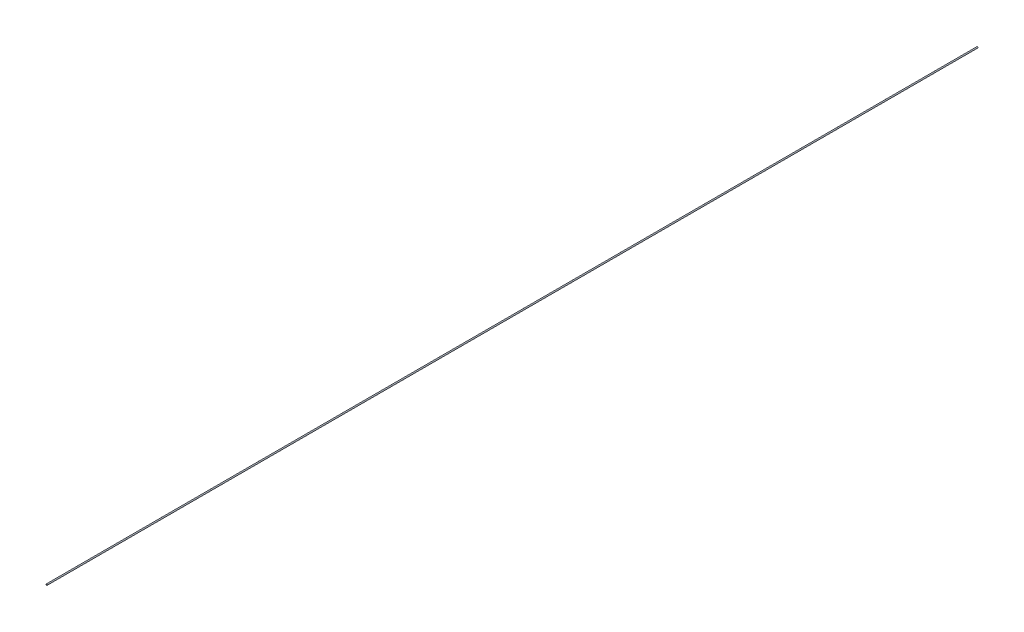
from build123d import *

# Parameters (mm, degrees)
ESQUISSE1_R      = 1.5
EXTRUSION1_DEPTH = 2360


with BuildPart() as part:
    # Esquisse1 → Extrusion1 (new body)
    with BuildSketch(Plane.XY.offset(-4090)):
        Circle(ESQUISSE1_R)
    extrude(amount=EXTRUSION1_DEPTH)


solid = part.part
